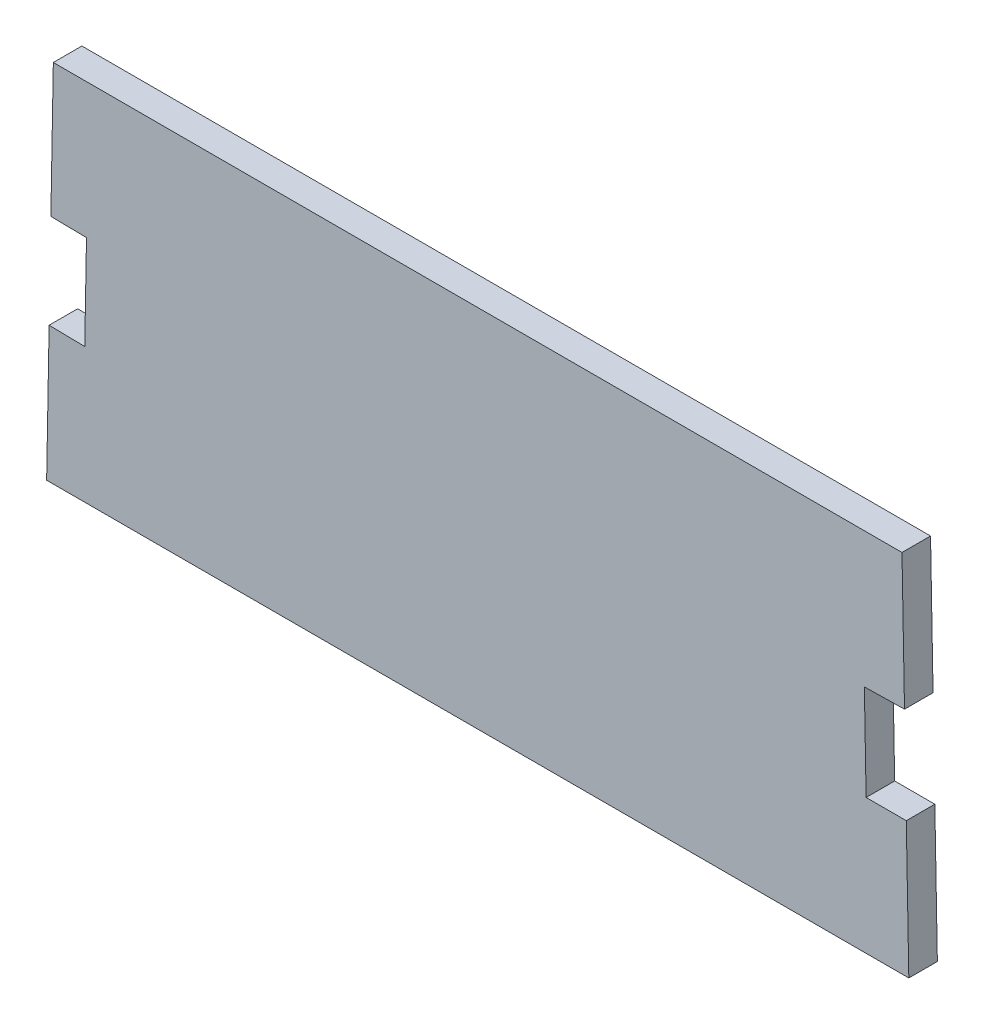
from build123d import *

# Parameters (mm, degrees)
BOSS_EXTRUDE1_DEPTH = 1.524


with BuildPart() as part:
    # Sketch1 → Boss-Extrude1 (new body)
    with BuildSketch(Plane.XY):
        Polygon((23.011853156, -9.745187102), (22.877083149, -2.539573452), (20.731983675, -2.539573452), (20.639129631, 2.526413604), (22.781597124, 2.565682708), (22.647315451, 9.745187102), (-22.654615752, 9.745187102), (-22.786197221, 2.56628579), (-20.884043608, 2.531421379), (-20.977138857, -2.547725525), (-22.879292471, -2.512861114), (-23.011853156, -9.745187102), align=None)
    extrude(amount=BOSS_EXTRUDE1_DEPTH)


solid = part.part
